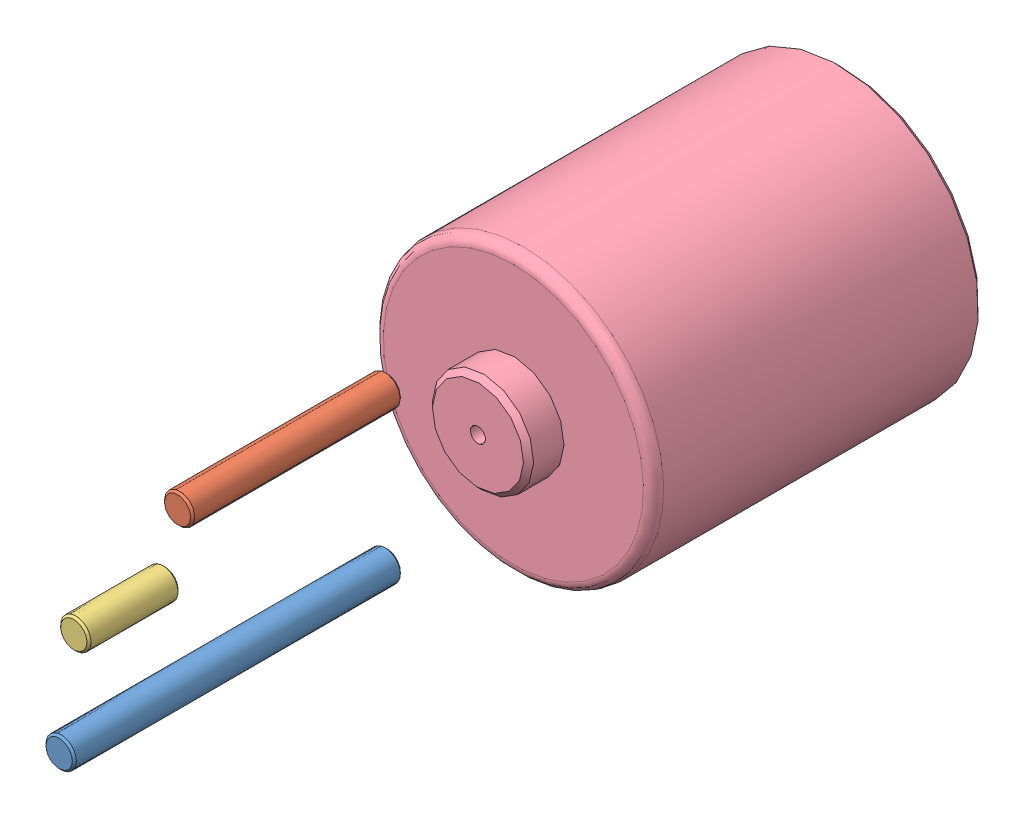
SolidWorks assembly bati_motoreducteur.SLDASM, configuration Défaut (file format 5000). Lengths in mm.
Overall size (88.14 88.14 88.14).
4 component instances, 4 part files, 9 mates.
Components (placement in the parent):
- axe_1-1: axe_1.SLDPRT [Défaut] at origin size (3 3 32.4)
- axe_2-1: axe_2.SLDPRT [Défaut] at (0 15 0) size (3 3 20.7)
- axe_couronne-1: axe_couronne.SLDPRT [Défaut] at (-2.5529 6.8924 19.4) x (0.973251 -0.229746 0) z (0 0 1) size (3 3 9)
- stator_moteur-1: stator_moteur.SLDPRT [Défaut] at (3.7712 10.3333 -41.3) x (0.687988 -0.725722 0) z (0 0 1) size (27.7 27.7 38.3)
Mates (geometry in assembly coordinates):
- Coïncidente1: coincident: axis of axe_2-1 through (0 15 20.5) axis (0 0 -1); plane of assembly
- Distance1: distance = 15 mm: axis of axe_1-1 through (0 0 32.2) axis (0 0 -1); axis of axe_2-1 through (0 15 20.5) axis (0 0 -1)
- Coïncidente3: coincident aligned: plane of axe_1-1 through (0 0 0) normal (0 0 -1); plane of axe_2-1 through (0 15 0) normal (0 0 -1)
- Distance3: distance = 7.35 mm: axis of axe_1-1 through (0 0 32.2) axis (0 0 -1); axis of axe_couronne-1 through (-2.5529 6.8924 28.2) axis (0 0 -1)
- Distance4: distance = 8.5 mm: axis of axe_2-1 through (0 15 20.5) axis (0 0 -1); axis of axe_couronne-1 through (-2.5529 6.8924 28.2) axis (0 0 -1)
- Distance5: distance = 4 mm aligned: plane of axe_1-1 through (0 0 32.4) normal (0 0 1); plane of axe_couronne-1 through (-2.5529 6.8924 28.4) normal (0 0 1)
- Distance6: distance = 6 mm: axis of axe_2-1 through (0 15 20.5) axis (0 0 -1); axis of stator_moteur-1 through (3.7712 10.3333 -9.7) axis (0 0 -1)
- Distance7: distance = 11 mm: axis of axe_1-1 through (0 0 32.2) axis (0 0 -1); axis of stator_moteur-1 through (3.7712 10.3333 -9.7) axis (0 0 -1)
- Distance8: distance = 8.7 mm anti-aligned: plane of axe_1-1 through (0 0 0) normal (0 0 -1); plane of stator_moteur-1 through (3.7712 10.3333 -8.7) normal (0 0 1)
